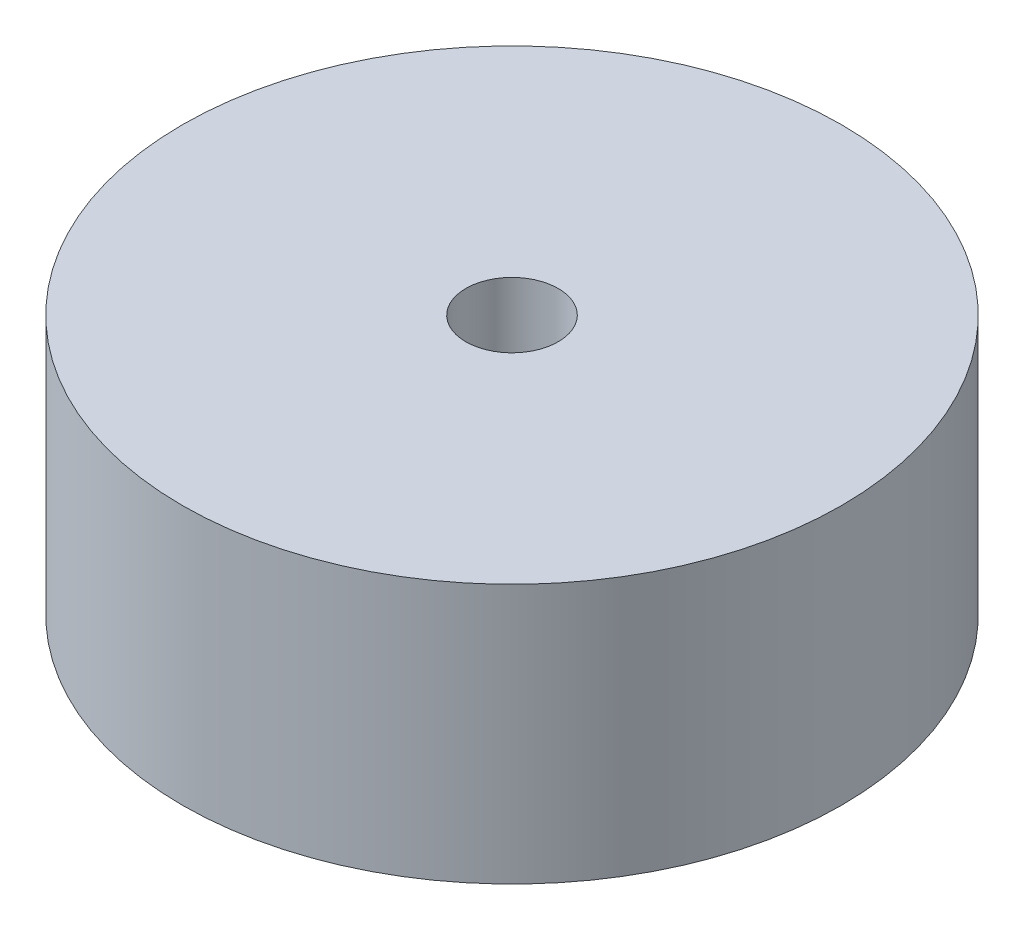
from build123d import *

# Parameters (mm, degrees)
SKETCH1_R           = 6.35
BOSS_EXTRUDE1_DEPTH = 5
SKETCH2_R           = 0.89
CUT_EXTRUDE1_DEPTH  = 8


with BuildPart() as part:
    # Sketch1 → Boss-Extrude1 (new body)
    with BuildSketch(Plane(origin=(0, 0, 0), x_dir=(1, 0, 0), z_dir=(0, 1, 0))):
        with Locations(Location((-10.54337341, 3.571016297, 0), (0, 0, 270))):
            Circle(SKETCH1_R)
    extrude(amount=BOSS_EXTRUDE1_DEPTH)

    # Sketch2 → Cut-Extrude1 (cut)
    with BuildSketch(Plane(origin=(0, 5, 0), x_dir=(1, 0, 0), z_dir=(0, 1, 0))):
        with Locations(Location((-10.54337341, 3.571016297, 0), (0, 0, 270))):
            Circle(SKETCH2_R)
    extrude(amount=-CUT_EXTRUDE1_DEPTH, mode=Mode.SUBTRACT)


solid = part.part
